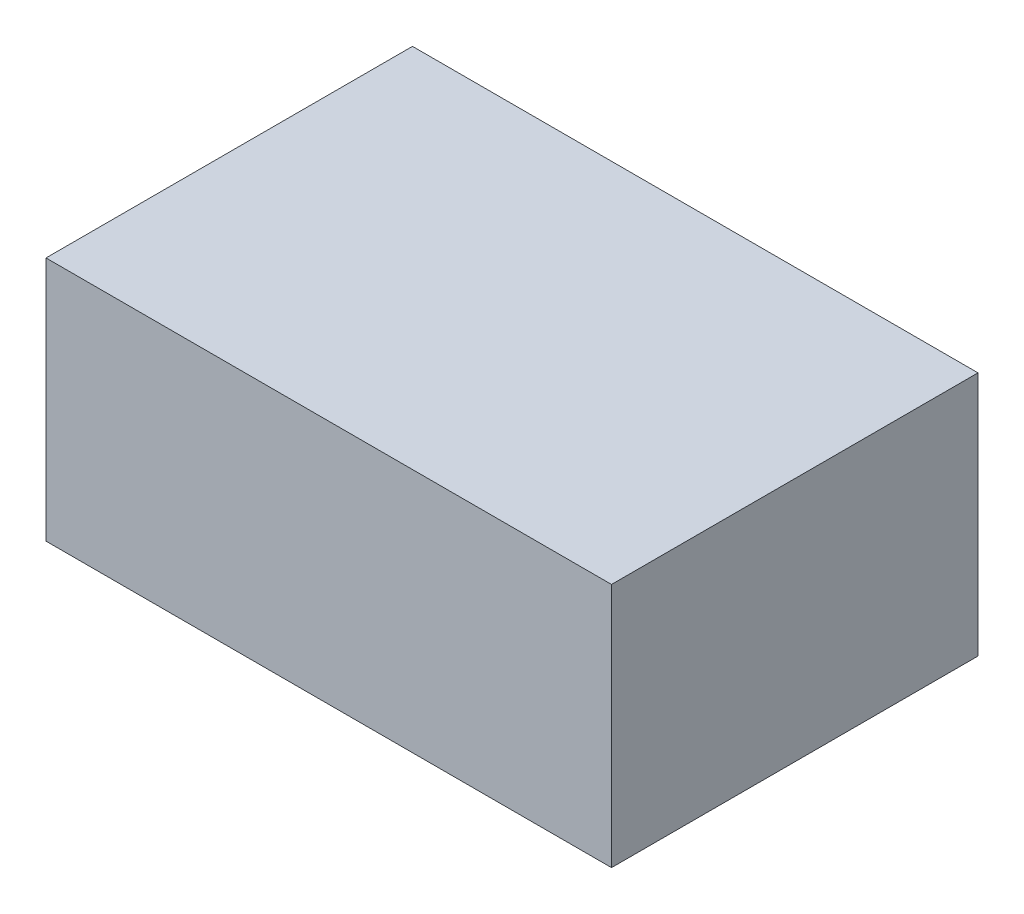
ISO-10303-21;
HEADER;
FILE_DESCRIPTION(('STEP AP214'),'2;1');
FILE_NAME('part.step','',(''),(''),'','','');
FILE_SCHEMA(('AUTOMOTIVE_DESIGN { 1 0 10303 214 1 1 1 1 }'));
ENDSEC;
DATA;
#1=APPLICATION_CONTEXT('core data for automotive mechanical design processes');
#2=APPLICATION_PROTOCOL_DEFINITION('international standard','automotive_design',2000,#1);
#3=PRODUCT_CONTEXT('',#1,'mechanical');
#4=PRODUCT('Part','Part','',(#3));
#5=PRODUCT_RELATED_PRODUCT_CATEGORY('part','',(#4));
#6=PRODUCT_DEFINITION_FORMATION('','',#4);
#7=PRODUCT_DEFINITION_CONTEXT('part definition',#1,'design');
#8=PRODUCT_DEFINITION('design','',#6,#7);
#9=PRODUCT_DEFINITION_SHAPE('','',#8);
#10=(LENGTH_UNIT() NAMED_UNIT(*) SI_UNIT(.MILLI.,.METRE.));
#11=(NAMED_UNIT(*) PLANE_ANGLE_UNIT() SI_UNIT($,.RADIAN.));
#12=(NAMED_UNIT(*) SI_UNIT($,.STERADIAN.) SOLID_ANGLE_UNIT());
#13=UNCERTAINTY_MEASURE_WITH_UNIT(LENGTH_MEASURE(1.E-05),#10,'distance_accuracy_value','');
#14=(GEOMETRIC_REPRESENTATION_CONTEXT(3) GLOBAL_UNCERTAINTY_ASSIGNED_CONTEXT((#13)) GLOBAL_UNIT_ASSIGNED_CONTEXT((#10,
#11,#12)) REPRESENTATION_CONTEXT('',''));
#15=CARTESIAN_POINT('',(0.,0.,0.));
#16=DIRECTION('',(0.,0.,1.));
#17=DIRECTION('',(1.,0.,0.));
#18=AXIS2_PLACEMENT_3D('',#15,#16,#17);
#19=CARTESIAN_POINT('',(-55.8773791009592,48.4691209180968,-36.2109426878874));
#20=DIRECTION('',(1.,0.,0.));
#21=DIRECTION('',(0.,0.,-1.));
#22=AXIS2_PLACEMENT_3D('',#19,#20,#21);
#23=PLANE('',#22);
#24=DIRECTION('',(0.,0.,1.));
#25=VECTOR('',#24,1.);
#26=CARTESIAN_POINT('',(-55.8773791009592,0.,-36.2109426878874));
#27=LINE('',#26,#25);
#28=CARTESIAN_POINT('',(-55.8773791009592,0.,-36.2109426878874));
#29=VERTEX_POINT('',#28);
#30=CARTESIAN_POINT('',(-55.8773791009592,0.,36.2109426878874));
#31=VERTEX_POINT('',#30);
#32=EDGE_CURVE('E76',#29,#31,#27,.T.);
#33=ORIENTED_EDGE('',*,*,#32,.T.);
#34=DIRECTION('',(0.,-1.,0.));
#35=VECTOR('',#34,1.);
#36=CARTESIAN_POINT('',(-55.8773791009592,48.4691209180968,36.2109426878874));
#37=LINE('',#36,#35);
#38=CARTESIAN_POINT('',(-55.8773791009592,48.4691209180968,36.2109426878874));
#39=VERTEX_POINT('',#38);
#40=EDGE_CURVE('E11',#39,#31,#37,.T.);
#41=ORIENTED_EDGE('',*,*,#40,.F.);
#42=DIRECTION('',(0.,0.,1.));
#43=VECTOR('',#42,1.);
#44=CARTESIAN_POINT('',(-55.8773791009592,48.4691209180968,-36.2109426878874));
#45=LINE('',#44,#43);
#46=CARTESIAN_POINT('',(-55.8773791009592,48.4691209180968,-36.2109426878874));
#47=VERTEX_POINT('',#46);
#48=EDGE_CURVE('E94',#47,#39,#45,.T.);
#49=ORIENTED_EDGE('',*,*,#48,.F.);
#50=DIRECTION('',(0.,-1.,0.));
#51=VECTOR('',#50,1.);
#52=CARTESIAN_POINT('',(-55.8773791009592,48.4691209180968,-36.2109426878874));
#53=LINE('',#52,#51);
#54=EDGE_CURVE('E88',#47,#29,#53,.T.);
#55=ORIENTED_EDGE('',*,*,#54,.T.);
#56=EDGE_LOOP('',(#33,#41,#49,#55));
#57=FACE_BOUND('',#56,.T.);
#58=ADVANCED_FACE('F32',(#57),#23,.F.);
#59=CARTESIAN_POINT('',(-55.8773791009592,48.4691209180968,36.2109426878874));
#60=DIRECTION('',(0.,0.,-1.));
#61=DIRECTION('',(-1.,0.,0.));
#62=AXIS2_PLACEMENT_3D('',#59,#60,#61);
#63=PLANE('',#62);
#64=DIRECTION('',(1.,0.,0.));
#65=VECTOR('',#64,1.);
#66=CARTESIAN_POINT('',(-55.8773791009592,0.,36.2109426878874));
#67=LINE('',#66,#65);
#68=CARTESIAN_POINT('',(55.8773791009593,0.,36.2109426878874));
#69=VERTEX_POINT('',#68);
#70=EDGE_CURVE('E72',#31,#69,#67,.T.);
#71=ORIENTED_EDGE('',*,*,#70,.T.);
#72=DIRECTION('',(0.,-1.,0.));
#73=VECTOR('',#72,1.);
#74=CARTESIAN_POINT('',(55.8773791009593,48.4691209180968,36.2109426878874));
#75=LINE('',#74,#73);
#76=CARTESIAN_POINT('',(55.8773791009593,48.4691209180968,36.2109426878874));
#77=VERTEX_POINT('',#76);
#78=EDGE_CURVE('E39',#77,#69,#75,.T.);
#79=ORIENTED_EDGE('',*,*,#78,.F.);
#80=DIRECTION('',(1.,0.,0.));
#81=VECTOR('',#80,1.);
#82=CARTESIAN_POINT('',(-55.8773791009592,48.4691209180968,36.2109426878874));
#83=LINE('',#82,#81);
#84=EDGE_CURVE('E84',#39,#77,#83,.T.);
#85=ORIENTED_EDGE('',*,*,#84,.F.);
#86=ORIENTED_EDGE('',*,*,#40,.T.);
#87=EDGE_LOOP('',(#71,#79,#85,#86));
#88=FACE_BOUND('',#87,.T.);
#89=ADVANCED_FACE('F83',(#88),#63,.F.);
#90=CARTESIAN_POINT('',(55.8773791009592,48.4691209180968,-36.2109426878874));
#91=DIRECTION('',(-1.,0.,0.));
#92=DIRECTION('',(0.,0.,1.));
#93=AXIS2_PLACEMENT_3D('',#90,#91,#92);
#94=PLANE('',#93);
#95=DIRECTION('',(0.,0.,-1.));
#96=VECTOR('',#95,1.);
#97=CARTESIAN_POINT('',(55.8773791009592,0.,-36.2109426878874));
#98=LINE('',#97,#96);
#99=CARTESIAN_POINT('',(55.8773791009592,0.,-36.2109426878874));
#100=VERTEX_POINT('',#99);
#101=EDGE_CURVE('E77',#69,#100,#98,.T.);
#102=ORIENTED_EDGE('',*,*,#101,.T.);
#103=DIRECTION('',(0.,-1.,0.));
#104=VECTOR('',#103,1.);
#105=CARTESIAN_POINT('',(55.8773791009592,48.4691209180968,-36.2109426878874));
#106=LINE('',#105,#104);
#107=CARTESIAN_POINT('',(55.8773791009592,48.4691209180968,-36.2109426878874));
#108=VERTEX_POINT('',#107);
#109=EDGE_CURVE('E100',#108,#100,#106,.T.);
#110=ORIENTED_EDGE('',*,*,#109,.F.);
#111=DIRECTION('',(0.,0.,-1.));
#112=VECTOR('',#111,1.);
#113=CARTESIAN_POINT('',(55.8773791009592,48.4691209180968,-36.2109426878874));
#114=LINE('',#113,#112);
#115=EDGE_CURVE('E51',#77,#108,#114,.T.);
#116=ORIENTED_EDGE('',*,*,#115,.F.);
#117=ORIENTED_EDGE('',*,*,#78,.T.);
#118=EDGE_LOOP('',(#102,#110,#116,#117));
#119=FACE_BOUND('',#118,.T.);
#120=ADVANCED_FACE('F103',(#119),#94,.F.);
#121=CARTESIAN_POINT('',(-55.8773791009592,48.4691209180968,-36.2109426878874));
#122=DIRECTION('',(0.,0.,1.));
#123=DIRECTION('',(1.,0.,0.));
#124=AXIS2_PLACEMENT_3D('',#121,#122,#123);
#125=PLANE('',#124);
#126=DIRECTION('',(-1.,0.,0.));
#127=VECTOR('',#126,1.);
#128=CARTESIAN_POINT('',(-55.8773791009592,0.,-36.2109426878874));
#129=LINE('',#128,#127);
#130=EDGE_CURVE('E92',#100,#29,#129,.T.);
#131=ORIENTED_EDGE('',*,*,#130,.T.);
#132=ORIENTED_EDGE('',*,*,#54,.F.);
#133=DIRECTION('',(-1.,0.,0.));
#134=VECTOR('',#133,1.);
#135=CARTESIAN_POINT('',(-55.8773791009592,48.4691209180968,-36.2109426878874));
#136=LINE('',#135,#134);
#137=EDGE_CURVE('E46',#108,#47,#136,.T.);
#138=ORIENTED_EDGE('',*,*,#137,.F.);
#139=ORIENTED_EDGE('',*,*,#109,.T.);
#140=EDGE_LOOP('',(#131,#132,#138,#139));
#141=FACE_BOUND('',#140,.T.);
#142=ADVANCED_FACE('F105',(#141),#125,.F.);
#143=CARTESIAN_POINT('',(-55.8773791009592,48.4691209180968,36.2109426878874));
#144=DIRECTION('',(0.,1.,0.));
#145=DIRECTION('',(0.,0.,1.));
#146=AXIS2_PLACEMENT_3D('',#143,#144,#145);
#147=PLANE('',#146);
#148=ORIENTED_EDGE('',*,*,#48,.T.);
#149=ORIENTED_EDGE('',*,*,#84,.T.);
#150=ORIENTED_EDGE('',*,*,#115,.T.);
#151=ORIENTED_EDGE('',*,*,#137,.T.);
#152=EDGE_LOOP('',(#148,#149,#150,#151));
#153=FACE_BOUND('',#152,.T.);
#154=ADVANCED_FACE('F106',(#153),#147,.T.);
#155=CARTESIAN_POINT('',(-55.8773791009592,0.,36.2109426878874));
#156=DIRECTION('',(0.,1.,0.));
#157=DIRECTION('',(0.,0.,1.));
#158=AXIS2_PLACEMENT_3D('',#155,#156,#157);
#159=PLANE('',#158);
#160=ORIENTED_EDGE('',*,*,#32,.F.);
#161=ORIENTED_EDGE('',*,*,#130,.F.);
#162=ORIENTED_EDGE('',*,*,#101,.F.);
#163=ORIENTED_EDGE('',*,*,#70,.F.);
#164=EDGE_LOOP('',(#160,#161,#162,#163));
#165=FACE_BOUND('',#164,.T.);
#166=ADVANCED_FACE('F73',(#165),#159,.F.);
#167=CLOSED_SHELL('',(#58,#89,#120,#142,#154,#166));
#168=MANIFOLD_SOLID_BREP('B2',#167);
#169=ADVANCED_BREP_SHAPE_REPRESENTATION('',(#18,#168),#14);
#170=SHAPE_DEFINITION_REPRESENTATION(#9,#169);
ENDSEC;
END-ISO-10303-21;
